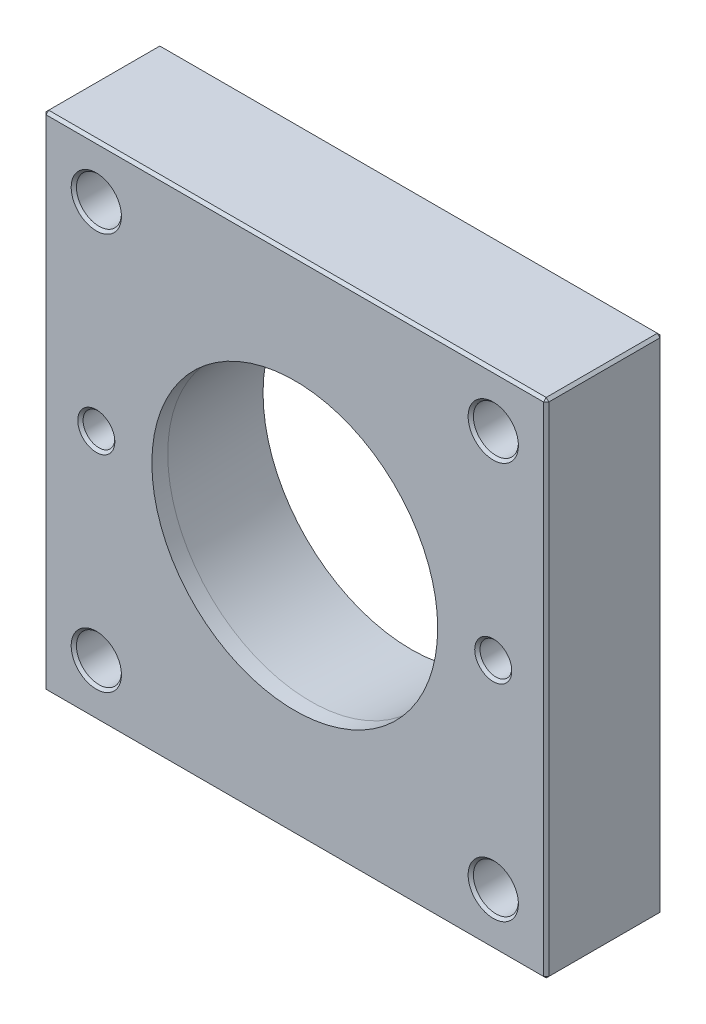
from build123d import *

# Parameters (mm, degrees)
ESQUISSE1_W             = 95
ESQUISSE1_H             = 95
ESQUISSE1_R             = 27
ESQUISSE1_R_2           = 4.25
ESQUISSE1_R_3           = 3
BASE_EXTRUSION_DEPTH    = 22
ESQUISSE2_R             = 27
ENL_V_MAT_EXTRU_3_DEPTH = 19
ENL_V_MAT_EXTRU_3_DRAFT = 3
CHANFREIN1_SIZE         = 0.5
CHANFREIN2_SIZE         = 0.5
CHANFREIN3_SIZE         = 0.5


with BuildPart() as part:
    # Esquisse1 → Base-Extrusion (new body)
    with BuildSketch(Plane.XY):
        Rectangle(ESQUISSE1_W, ESQUISSE1_H)
        Circle(ESQUISSE1_R, mode=Mode.SUBTRACT)
        with Locations((-37.5, -37.5)):
            Circle(ESQUISSE1_R_2, mode=Mode.SUBTRACT)
        with Locations(Location((-37.5, 37.5, 0), (0, 0, 180))):
            Circle(ESQUISSE1_R_2, mode=Mode.SUBTRACT)
        with Locations(Location((37.5, -37.5, 0), (0, 0, 180))):
            Circle(ESQUISSE1_R_2, mode=Mode.SUBTRACT)
        with Locations((37.5, 37.5)):
            Circle(ESQUISSE1_R_2, mode=Mode.SUBTRACT)
        with Locations((-37.5, 0)):
            Circle(ESQUISSE1_R_3, mode=Mode.SUBTRACT)
        with Locations(Location((37.5, 0, 0), (0, 0, 180))):
            Circle(ESQUISSE1_R_3, mode=Mode.SUBTRACT)
    extrude(amount=-BASE_EXTRUSION_DEPTH)


with BuildPart() as enl_v_mat_extru_3_tool:
    # Esquisse2 → Enl_v. mat.-Extru.3 (with draft: the straight prism first)
    with BuildSketch(Plane.XY.offset(-3)):
        Circle(ESQUISSE2_R)
    extrude(amount=-ENL_V_MAT_EXTRU_3_DEPTH)
    # Enl_v. mat.-Extru.3: the draft: its side faces are tilted about the plane it starts from
    enl_v_mat_extru_3_sides = [enl_v_mat_extru_3_tool.faces().sort_by_distance(p)[0] for p in [
        (-27, 0, -12.5),
    ]]
    draft(enl_v_mat_extru_3_sides, Plane.XY.offset(-3), ENL_V_MAT_EXTRU_3_DRAFT)


with BuildPart() as part_1:
    add(part.part)

    # Enl_v. mat.-Extru.3: cut by enl_v_mat_extru_3_tool
    add(enl_v_mat_extru_3_tool.part, mode=Mode.SUBTRACT)

    # Chanfrein1
    chanfrein1_edges = [part_1.edges().sort_by_distance(p)[0] for p in [
        (-41.75, -37.5, 0),
        (-33.25, 37.5, 0),
        (41.75, -37.5, 0),
        (33.25, 37.5, 0),
        (-40.5, 0, 0),
        (40.5, 0, 0),
    ]]
    chamfer(chanfrein1_edges, length=CHANFREIN1_SIZE)

    # Chanfrein2
    chanfrein2_edges = [part_1.edges().sort_by_distance(p)[0] for p in [
        (-41.75, -37.5, -22),
        (-33.25, 37.5, -22),
        (41.75, -37.5, -22),
        (33.25, 37.5, -22),
        (-40.5, 0, -22),
        (40.5, 0, -22),
    ]]
    chamfer(chanfrein2_edges, length=CHANFREIN2_SIZE)

    # Chanfrein3
    chanfrein3_edges = [part_1.edges().sort_by_distance(p)[0] for p in [
        (47.5, 0, -22),
        (0, -47.5, -22),
        (-47.5, 0, -22),
        (0, -47.5, 0),
        (47.5, 0, 0),
        (0, 47.5, 0),
        (-47.5, 0, 0),
        (0, 47.5, -22),
        (-47.5, -47.5, -11),
        (47.5, -47.5, -11),
        (47.5, 47.5, -11),
        (-47.5, 47.5, -11),
    ]]
    chamfer(chanfrein3_edges, length=CHANFREIN3_SIZE)


solid = part_1.part
